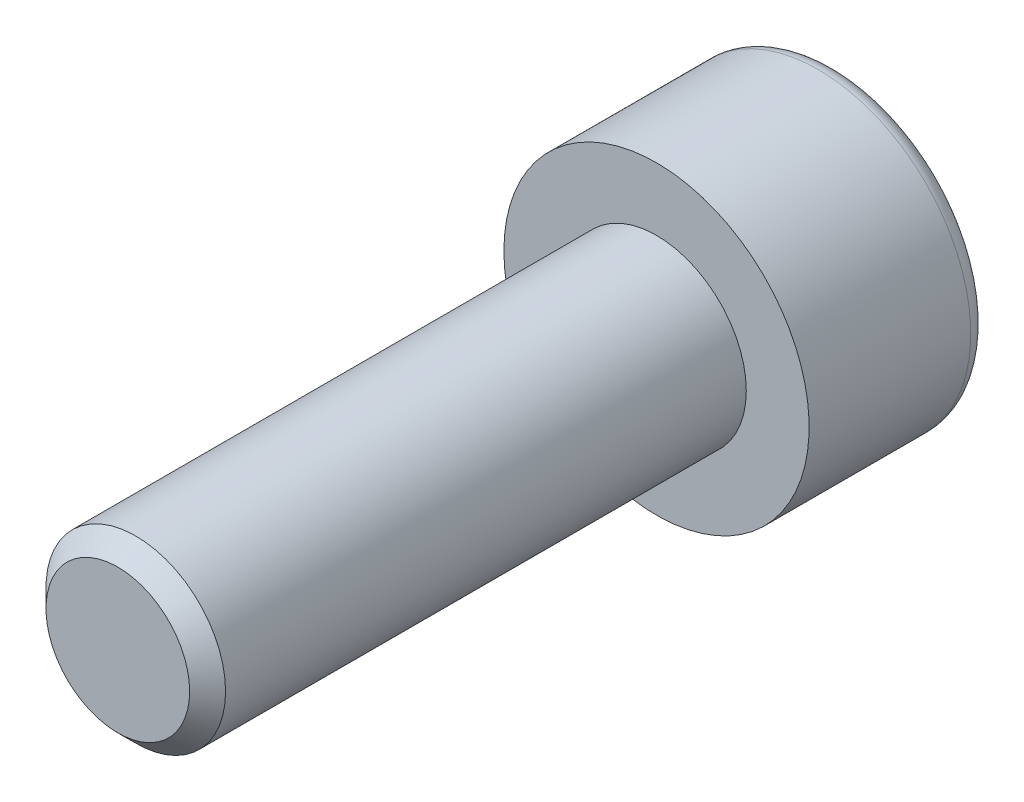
from build123d import *

# Parameters (mm, degrees)
ENLEV_MAT_EXTRU1_DEPTH = 2.5
ESQUISSE3_W            = 2.5
ESQUISSE3_H            = 15
CHANFREIN1_SIZE        = 0.5


with BuildPart() as part:
    # Esquisse1 → Base-R_volution (revolve)
    with BuildSketch(Plane(origin=(0, 0, 0), x_dir=(1, 0, 0), z_dir=(0, 1, 0)), mode=Mode.PRIVATE) as base_r_volution_sk:
        with BuildLine():
            Line((0, 0), (4.25, 0))
            Line((4.25, 0), (4.25, 4.5))
            ThreePointArc((4.25, 4.5), (4.103553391, 4.853553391), (3.75, 5))
            Line((3.75, 5), (0, 5))
            Line((0, 5), (0, 0))
        make_face()
    revolve(base_r_volution_sk.sketch.rotate(Axis((0, 0, 0), (0, 0, -1)), 180), axis=Axis((0, 0, 0), (0, 0, -1)))

    # Esquisse2 → enlev-mat-Extru1 (cut)
    with BuildSketch(Plane.XY.offset(-5)):
        Polygon((2, -1.154700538), (2, 1.154700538), (0, 2.309401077), (-2, 1.154700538), (-2, -1.154700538), (0, -2.309401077), align=None)
    extrude(amount=ENLEV_MAT_EXTRU1_DEPTH, mode=Mode.SUBTRACT)

    # Esquisse3 → Boss.-R_vol.1 (revolve)
    with BuildSketch(Plane(origin=(0, 0, 0), x_dir=(1, 0, 0), z_dir=(0, 1, 0))):
        with Locations((1.25, -7.5)):
            Rectangle(ESQUISSE3_W, ESQUISSE3_H)
    revolve(axis=Axis((0, 0, 0), (0, 0, 1)))

    # Chanfrein1
    chanfrein1_edges = [part.edges().sort_by_distance(p)[0] for p in [
        (-2.5, 0, 15),
    ]]
    chamfer(chanfrein1_edges, length=CHANFREIN1_SIZE)


solid = part.part
